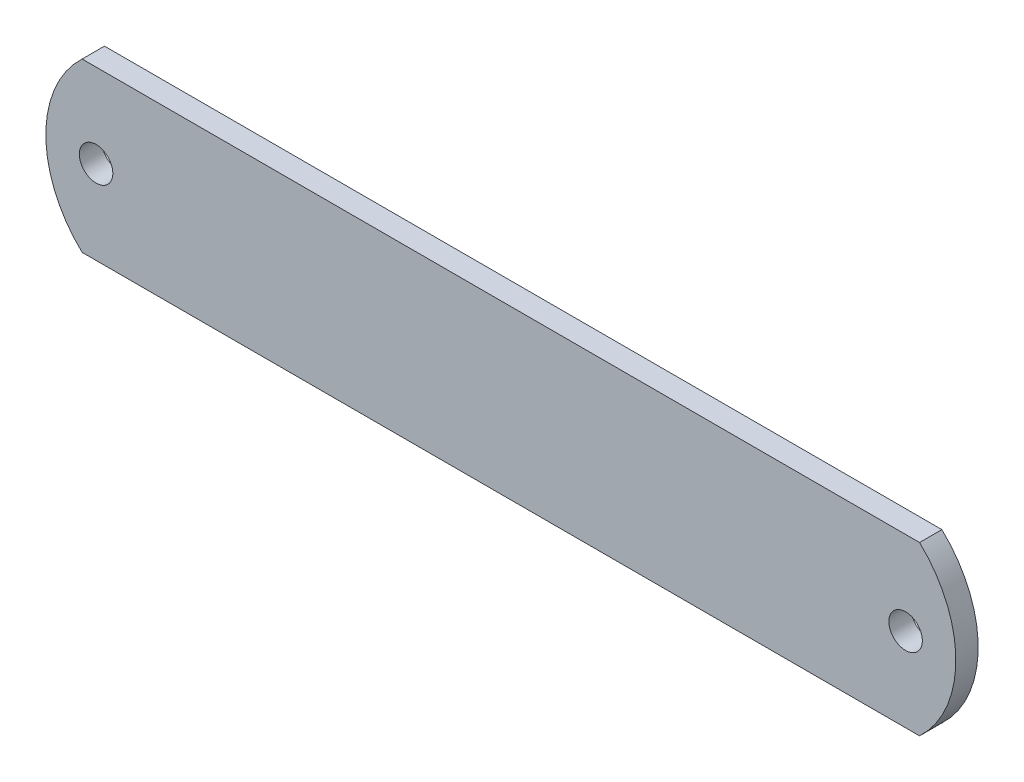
ISO-10303-21;
HEADER;
FILE_DESCRIPTION(('STEP AP214'),'2;1');
FILE_NAME('part.step','',(''),(''),'','','');
FILE_SCHEMA(('AUTOMOTIVE_DESIGN { 1 0 10303 214 1 1 1 1 }'));
ENDSEC;
DATA;
#1=APPLICATION_CONTEXT('core data for automotive mechanical design processes');
#2=APPLICATION_PROTOCOL_DEFINITION('international standard','automotive_design',2000,#1);
#3=PRODUCT_CONTEXT('',#1,'mechanical');
#4=PRODUCT('Part','Part','',(#3));
#5=PRODUCT_RELATED_PRODUCT_CATEGORY('part','',(#4));
#6=PRODUCT_DEFINITION_FORMATION('','',#4);
#7=PRODUCT_DEFINITION_CONTEXT('part definition',#1,'design');
#8=PRODUCT_DEFINITION('design','',#6,#7);
#9=PRODUCT_DEFINITION_SHAPE('','',#8);
#10=(LENGTH_UNIT() NAMED_UNIT(*) SI_UNIT(.MILLI.,.METRE.));
#11=(NAMED_UNIT(*) PLANE_ANGLE_UNIT() SI_UNIT($,.RADIAN.));
#12=(NAMED_UNIT(*) SI_UNIT($,.STERADIAN.) SOLID_ANGLE_UNIT());
#13=UNCERTAINTY_MEASURE_WITH_UNIT(LENGTH_MEASURE(1.E-05),#10,'distance_accuracy_value','');
#14=(GEOMETRIC_REPRESENTATION_CONTEXT(3) GLOBAL_UNCERTAINTY_ASSIGNED_CONTEXT((#13)) GLOBAL_UNIT_ASSIGNED_CONTEXT((#10,
#11,#12)) REPRESENTATION_CONTEXT('',''));
#15=CARTESIAN_POINT('',(0.,0.,0.));
#16=DIRECTION('',(0.,0.,1.));
#17=DIRECTION('',(1.,0.,0.));
#18=AXIS2_PLACEMENT_3D('',#15,#16,#17);
#19=CARTESIAN_POINT('',(20.5576923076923,15.,4.));
#20=DIRECTION('',(0.,0.,-1.));
#21=DIRECTION('',(-1.,0.,0.));
#22=AXIS2_PLACEMENT_3D('',#19,#20,#21);
#23=PLANE('',#22);
#24=CARTESIAN_POINT('',(20.5576923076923,15.,4.));
#25=DIRECTION('',(0.,0.,1.));
#26=DIRECTION('',(-1.,0.,0.));
#27=AXIS2_PLACEMENT_3D('',#24,#25,#26);
#28=CIRCLE('',#27,20.5576923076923);
#29=CARTESIAN_POINT('',(6.50000000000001,30.,4.));
#30=VERTEX_POINT('',#29);
#31=CARTESIAN_POINT('',(6.50000000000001,0.,4.));
#32=VERTEX_POINT('',#31);
#33=EDGE_CURVE('E89',#30,#32,#28,.T.);
#34=ORIENTED_EDGE('',*,*,#33,.T.);
#35=DIRECTION('',(1.,0.,0.));
#36=VECTOR('',#35,1.);
#37=CARTESIAN_POINT('',(6.50000000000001,0.,4.));
#38=LINE('',#37,#36);
#39=CARTESIAN_POINT('',(156.5,0.,4.));
#40=VERTEX_POINT('',#39);
#41=EDGE_CURVE('E84',#32,#40,#38,.T.);
#42=ORIENTED_EDGE('',*,*,#41,.T.);
#43=CARTESIAN_POINT('',(142.442307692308,15.,4.));
#44=DIRECTION('',(0.,0.,1.));
#45=DIRECTION('',(1.,0.,0.));
#46=AXIS2_PLACEMENT_3D('',#43,#44,#45);
#47=CIRCLE('',#46,20.5576923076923);
#48=CARTESIAN_POINT('',(156.5,30.,4.));
#49=VERTEX_POINT('',#48);
#50=EDGE_CURVE('E87',#40,#49,#47,.T.);
#51=ORIENTED_EDGE('',*,*,#50,.T.);
#52=DIRECTION('',(-1.,0.,0.));
#53=VECTOR('',#52,1.);
#54=CARTESIAN_POINT('',(6.50000000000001,30.,4.));
#55=LINE('',#54,#53);
#56=EDGE_CURVE('E54',#49,#30,#55,.T.);
#57=ORIENTED_EDGE('',*,*,#56,.T.);
#58=EDGE_LOOP('',(#34,#42,#51,#57));
#59=FACE_BOUND('',#58,.T.);
#60=CARTESIAN_POINT('',(9.00000000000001,15.,4.));
#61=DIRECTION('',(0.,0.,1.));
#62=DIRECTION('',(1.,0.,0.));
#63=AXIS2_PLACEMENT_3D('',#60,#61,#62);
#64=CIRCLE('',#63,3.);
#65=CARTESIAN_POINT('',(12.,15.,4.));
#66=VERTEX_POINT('',#65);
#67=EDGE_CURVE('E105',#66,#66,#64,.T.);
#68=ORIENTED_EDGE('',*,*,#67,.F.);
#69=EDGE_LOOP('',(#68));
#70=FACE_BOUND('',#69,.T.);
#71=CARTESIAN_POINT('',(154.,15.,4.));
#72=DIRECTION('',(0.,0.,1.));
#73=DIRECTION('',(-1.,0.,0.));
#74=AXIS2_PLACEMENT_3D('',#71,#72,#73);
#75=CIRCLE('',#74,2.99999999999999);
#76=CARTESIAN_POINT('',(151.,15.,4.));
#77=VERTEX_POINT('',#76);
#78=EDGE_CURVE('E121',#77,#77,#75,.T.);
#79=ORIENTED_EDGE('',*,*,#78,.F.);
#80=EDGE_LOOP('',(#79));
#81=FACE_BOUND('',#80,.T.);
#82=ADVANCED_FACE('F37',(#59,#70,#81),#23,.F.);
#83=CARTESIAN_POINT('',(20.5576923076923,15.,0.));
#84=DIRECTION('',(0.,0.,-1.));
#85=DIRECTION('',(-1.,0.,0.));
#86=AXIS2_PLACEMENT_3D('',#83,#84,#85);
#87=PLANE('',#86);
#88=CARTESIAN_POINT('',(9.00000000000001,15.,0.));
#89=DIRECTION('',(0.,0.,1.));
#90=DIRECTION('',(1.,0.,0.));
#91=AXIS2_PLACEMENT_3D('',#88,#89,#90);
#92=CIRCLE('',#91,3.);
#93=CARTESIAN_POINT('',(12.,15.,0.));
#94=VERTEX_POINT('',#93);
#95=EDGE_CURVE('E118',#94,#94,#92,.T.);
#96=ORIENTED_EDGE('',*,*,#95,.T.);
#97=EDGE_LOOP('',(#96));
#98=FACE_BOUND('',#97,.T.);
#99=CARTESIAN_POINT('',(20.5576923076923,15.,0.));
#100=DIRECTION('',(0.,0.,1.));
#101=DIRECTION('',(-1.,0.,0.));
#102=AXIS2_PLACEMENT_3D('',#99,#100,#101);
#103=CIRCLE('',#102,20.5576923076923);
#104=CARTESIAN_POINT('',(6.50000000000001,30.,0.));
#105=VERTEX_POINT('',#104);
#106=CARTESIAN_POINT('',(6.50000000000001,0.,0.));
#107=VERTEX_POINT('',#106);
#108=EDGE_CURVE('E102',#105,#107,#103,.T.);
#109=ORIENTED_EDGE('',*,*,#108,.F.);
#110=DIRECTION('',(-1.,0.,0.));
#111=VECTOR('',#110,1.);
#112=CARTESIAN_POINT('',(6.50000000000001,30.,0.));
#113=LINE('',#112,#111);
#114=CARTESIAN_POINT('',(156.5,30.,0.));
#115=VERTEX_POINT('',#114);
#116=EDGE_CURVE('E77',#115,#105,#113,.T.);
#117=ORIENTED_EDGE('',*,*,#116,.F.);
#118=CARTESIAN_POINT('',(142.442307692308,15.,0.));
#119=DIRECTION('',(0.,0.,1.));
#120=DIRECTION('',(1.,0.,0.));
#121=AXIS2_PLACEMENT_3D('',#118,#119,#120);
#122=CIRCLE('',#121,20.5576923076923);
#123=CARTESIAN_POINT('',(156.5,0.,0.));
#124=VERTEX_POINT('',#123);
#125=EDGE_CURVE('E71',#124,#115,#122,.T.);
#126=ORIENTED_EDGE('',*,*,#125,.F.);
#127=DIRECTION('',(1.,0.,0.));
#128=VECTOR('',#127,1.);
#129=CARTESIAN_POINT('',(6.50000000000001,0.,0.));
#130=LINE('',#129,#128);
#131=EDGE_CURVE('E93',#107,#124,#130,.T.);
#132=ORIENTED_EDGE('',*,*,#131,.F.);
#133=EDGE_LOOP('',(#109,#117,#126,#132));
#134=FACE_BOUND('',#133,.T.);
#135=CARTESIAN_POINT('',(154.,15.,0.));
#136=DIRECTION('',(0.,0.,1.));
#137=DIRECTION('',(-1.,0.,0.));
#138=AXIS2_PLACEMENT_3D('',#135,#136,#137);
#139=CIRCLE('',#138,2.99999999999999);
#140=CARTESIAN_POINT('',(151.,15.,0.));
#141=VERTEX_POINT('',#140);
#142=EDGE_CURVE('E125',#141,#141,#139,.T.);
#143=ORIENTED_EDGE('',*,*,#142,.T.);
#144=EDGE_LOOP('',(#143));
#145=FACE_BOUND('',#144,.T.);
#146=ADVANCED_FACE('F114',(#98,#134,#145),#87,.T.);
#147=CARTESIAN_POINT('',(20.5576923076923,15.,4.));
#148=DIRECTION('',(0.,0.,-1.));
#149=DIRECTION('',(-1.,0.,0.));
#150=AXIS2_PLACEMENT_3D('',#147,#148,#149);
#151=CYLINDRICAL_SURFACE('',#150,20.5576923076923);
#152=ORIENTED_EDGE('',*,*,#108,.T.);
#153=DIRECTION('',(0.,0.,-1.));
#154=VECTOR('',#153,1.);
#155=CARTESIAN_POINT('',(6.50000000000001,0.,4.));
#156=LINE('',#155,#154);
#157=EDGE_CURVE('E11',#32,#107,#156,.T.);
#158=ORIENTED_EDGE('',*,*,#157,.F.);
#159=ORIENTED_EDGE('',*,*,#33,.F.);
#160=DIRECTION('',(0.,0.,-1.));
#161=VECTOR('',#160,1.);
#162=CARTESIAN_POINT('',(6.50000000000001,30.,4.));
#163=LINE('',#162,#161);
#164=EDGE_CURVE('E98',#30,#105,#163,.T.);
#165=ORIENTED_EDGE('',*,*,#164,.T.);
#166=EDGE_LOOP('',(#152,#158,#159,#165));
#167=FACE_BOUND('',#166,.T.);
#168=ADVANCED_FACE('F39',(#167),#151,.T.);
#169=CARTESIAN_POINT('',(6.50000000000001,0.,4.));
#170=DIRECTION('',(0.,1.,0.));
#171=DIRECTION('',(0.,0.,1.));
#172=AXIS2_PLACEMENT_3D('',#169,#170,#171);
#173=PLANE('',#172);
#174=ORIENTED_EDGE('',*,*,#131,.T.);
#175=DIRECTION('',(0.,0.,-1.));
#176=VECTOR('',#175,1.);
#177=CARTESIAN_POINT('',(156.5,0.,4.));
#178=LINE('',#177,#176);
#179=EDGE_CURVE('E46',#40,#124,#178,.T.);
#180=ORIENTED_EDGE('',*,*,#179,.F.);
#181=ORIENTED_EDGE('',*,*,#41,.F.);
#182=ORIENTED_EDGE('',*,*,#157,.T.);
#183=EDGE_LOOP('',(#174,#180,#181,#182));
#184=FACE_BOUND('',#183,.T.);
#185=ADVANCED_FACE('F92',(#184),#173,.F.);
#186=CARTESIAN_POINT('',(142.442307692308,15.,4.));
#187=DIRECTION('',(0.,0.,-1.));
#188=DIRECTION('',(-1.,0.,0.));
#189=AXIS2_PLACEMENT_3D('',#186,#187,#188);
#190=CYLINDRICAL_SURFACE('',#189,20.5576923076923);
#191=ORIENTED_EDGE('',*,*,#125,.T.);
#192=DIRECTION('',(0.,0.,-1.));
#193=VECTOR('',#192,1.);
#194=CARTESIAN_POINT('',(156.5,30.,4.));
#195=LINE('',#194,#193);
#196=EDGE_CURVE('E94',#49,#115,#195,.T.);
#197=ORIENTED_EDGE('',*,*,#196,.F.);
#198=ORIENTED_EDGE('',*,*,#50,.F.);
#199=ORIENTED_EDGE('',*,*,#179,.T.);
#200=EDGE_LOOP('',(#191,#197,#198,#199));
#201=FACE_BOUND('',#200,.T.);
#202=ADVANCED_FACE('F95',(#201),#190,.T.);
#203=CARTESIAN_POINT('',(6.50000000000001,30.,4.));
#204=DIRECTION('',(0.,-1.,0.));
#205=DIRECTION('',(0.,0.,-1.));
#206=AXIS2_PLACEMENT_3D('',#203,#204,#205);
#207=PLANE('',#206);
#208=ORIENTED_EDGE('',*,*,#116,.T.);
#209=ORIENTED_EDGE('',*,*,#164,.F.);
#210=ORIENTED_EDGE('',*,*,#56,.F.);
#211=ORIENTED_EDGE('',*,*,#196,.T.);
#212=EDGE_LOOP('',(#208,#209,#210,#211));
#213=FACE_BOUND('',#212,.T.);
#214=ADVANCED_FACE('F111',(#213),#207,.F.);
#215=CARTESIAN_POINT('',(9.00000000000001,15.,4.));
#216=DIRECTION('',(0.,0.,-1.));
#217=DIRECTION('',(-1.,0.,0.));
#218=AXIS2_PLACEMENT_3D('',#215,#216,#217);
#219=CYLINDRICAL_SURFACE('',#218,3.);
#220=ORIENTED_EDGE('',*,*,#67,.T.);
#221=EDGE_LOOP('',(#220));
#222=FACE_BOUND('',#221,.T.);
#223=ORIENTED_EDGE('',*,*,#95,.F.);
#224=EDGE_LOOP('',(#223));
#225=FACE_BOUND('',#224,.T.);
#226=ADVANCED_FACE('F144',(#222,#225),#219,.F.);
#227=CARTESIAN_POINT('',(154.,15.,4.));
#228=DIRECTION('',(0.,0.,-1.));
#229=DIRECTION('',(-1.,0.,0.));
#230=AXIS2_PLACEMENT_3D('',#227,#228,#229);
#231=CYLINDRICAL_SURFACE('',#230,2.99999999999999);
#232=ORIENTED_EDGE('',*,*,#78,.T.);
#233=EDGE_LOOP('',(#232));
#234=FACE_BOUND('',#233,.T.);
#235=ORIENTED_EDGE('',*,*,#142,.F.);
#236=EDGE_LOOP('',(#235));
#237=FACE_BOUND('',#236,.T.);
#238=ADVANCED_FACE('F133',(#234,#237),#231,.F.);
#239=CLOSED_SHELL('',(#82,#146,#168,#185,#202,#214,#226,#238));
#240=MANIFOLD_SOLID_BREP('B2',#239);
#241=ADVANCED_BREP_SHAPE_REPRESENTATION('',(#18,#240),#14);
#242=SHAPE_DEFINITION_REPRESENTATION(#9,#241);
ENDSEC;
END-ISO-10303-21;
